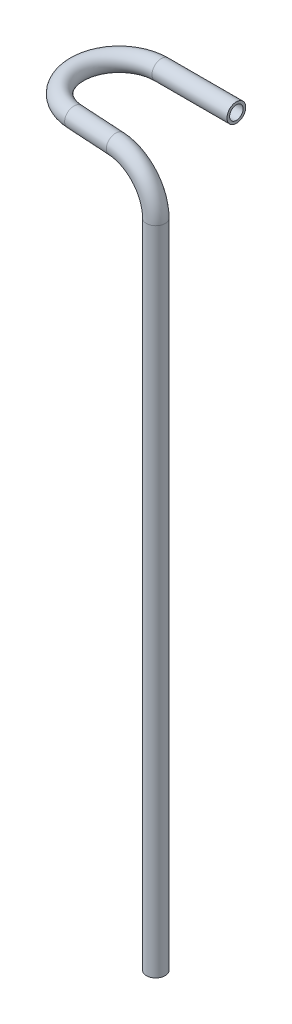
ISO-10303-21;
HEADER;
FILE_DESCRIPTION(('STEP AP214'),'2;1');
FILE_NAME('part.step','',(''),(''),'','','');
FILE_SCHEMA(('AUTOMOTIVE_DESIGN { 1 0 10303 214 1 1 1 1 }'));
ENDSEC;
DATA;
#1=APPLICATION_CONTEXT('core data for automotive mechanical design processes');
#2=APPLICATION_PROTOCOL_DEFINITION('international standard','automotive_design',2000,#1);
#3=PRODUCT_CONTEXT('',#1,'mechanical');
#4=PRODUCT('Part','Part','',(#3));
#5=PRODUCT_RELATED_PRODUCT_CATEGORY('part','',(#4));
#6=PRODUCT_DEFINITION_FORMATION('','',#4);
#7=PRODUCT_DEFINITION_CONTEXT('part definition',#1,'design');
#8=PRODUCT_DEFINITION('design','',#6,#7);
#9=PRODUCT_DEFINITION_SHAPE('','',#8);
#10=(LENGTH_UNIT() NAMED_UNIT(*) SI_UNIT(.MILLI.,.METRE.));
#11=(NAMED_UNIT(*) PLANE_ANGLE_UNIT() SI_UNIT($,.RADIAN.));
#12=(NAMED_UNIT(*) SI_UNIT($,.STERADIAN.) SOLID_ANGLE_UNIT());
#13=UNCERTAINTY_MEASURE_WITH_UNIT(LENGTH_MEASURE(1.E-05),#10,'distance_accuracy_value','');
#14=(GEOMETRIC_REPRESENTATION_CONTEXT(3) GLOBAL_UNCERTAINTY_ASSIGNED_CONTEXT((#13)) GLOBAL_UNIT_ASSIGNED_CONTEXT((#10,
#11,#12)) REPRESENTATION_CONTEXT('',''));
#15=CARTESIAN_POINT('',(0.,0.,0.));
#16=DIRECTION('',(0.,0.,1.));
#17=DIRECTION('',(1.,0.,0.));
#18=AXIS2_PLACEMENT_3D('',#15,#16,#17);
#19=CARTESIAN_POINT('',(3.02259999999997,-14.2875,30.3017233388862));
#20=DIRECTION('',(0.,-1.,0.));
#21=DIRECTION('',(1.,0.,0.));
#22=AXIS2_PLACEMENT_3D('',#19,#20,#21);
#23=CYLINDRICAL_SURFACE('',#22,3.175);
#24=CARTESIAN_POINT('',(3.02259999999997,-14.2875,30.3017233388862));
#25=DIRECTION('',(0.,1.,0.));
#26=DIRECTION('',(-0.0597452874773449,0.,0.998213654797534));
#27=AXIS2_PLACEMENT_3D('',#24,#25,#26);
#28=CIRCLE('',#27,3.175);
#29=CARTESIAN_POINT('',(6.19192835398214,-14.2875,30.4914146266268));
#30=VERTEX_POINT('',#29);
#31=EDGE_CURVE('E42',#30,#30,#28,.T.);
#32=ORIENTED_EDGE('',*,*,#31,.F.);
#33=EDGE_LOOP('',(#32));
#34=FACE_BOUND('',#33,.T.);
#35=CARTESIAN_POINT('',(3.02260000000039,-234.95,30.301723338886));
#36=DIRECTION('',(0.,1.,0.));
#37=DIRECTION('',(-0.0597452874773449,0.,0.998213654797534));
#38=AXIS2_PLACEMENT_3D('',#35,#36,#37);
#39=CIRCLE('',#38,3.175);
#40=CARTESIAN_POINT('',(2.83290871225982,-234.95,33.4710516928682));
#41=VERTEX_POINT('',#40);
#42=EDGE_CURVE('E10',#41,#41,#39,.T.);
#43=ORIENTED_EDGE('',*,*,#42,.T.);
#44=EDGE_LOOP('',(#43));
#45=FACE_BOUND('',#44,.T.);
#46=ADVANCED_FACE('F32',(#34,#45),#23,.T.);
#47=CARTESIAN_POINT('',(3.02259999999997,-14.2875,30.3017233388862));
#48=DIRECTION('',(0.,-1.,0.));
#49=DIRECTION('',(1.,0.,0.));
#50=AXIS2_PLACEMENT_3D('',#47,#48,#49);
#51=CYLINDRICAL_SURFACE('',#50,2.286);
#52=CARTESIAN_POINT('',(3.02259999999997,-14.2875,30.3017233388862));
#53=DIRECTION('',(0.,1.,0.));
#54=DIRECTION('',(-0.0597452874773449,0.,0.998213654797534));
#55=AXIS2_PLACEMENT_3D('',#52,#53,#54);
#56=CIRCLE('',#55,2.286);
#57=CARTESIAN_POINT('',(5.30451641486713,-14.2875,30.4383010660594));
#58=VERTEX_POINT('',#57);
#59=EDGE_CURVE('E46',#58,#58,#56,.T.);
#60=ORIENTED_EDGE('',*,*,#59,.T.);
#61=EDGE_LOOP('',(#60));
#62=FACE_BOUND('',#61,.T.);
#63=CARTESIAN_POINT('',(3.02260000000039,-234.95,30.301723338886));
#64=DIRECTION('',(0.,1.,0.));
#65=DIRECTION('',(-0.0597452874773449,0.,0.998213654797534));
#66=AXIS2_PLACEMENT_3D('',#63,#64,#65);
#67=CIRCLE('',#66,2.286);
#68=CARTESIAN_POINT('',(2.88602227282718,-234.95,32.5836397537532));
#69=VERTEX_POINT('',#68);
#70=EDGE_CURVE('E38',#69,#69,#67,.T.);
#71=ORIENTED_EDGE('',*,*,#70,.F.);
#72=EDGE_LOOP('',(#71));
#73=FACE_BOUND('',#72,.T.);
#74=ADVANCED_FACE('F101',(#62,#73),#51,.F.);
#75=CARTESIAN_POINT('',(-11.2393775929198,-14.2875,29.4481125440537));
#76=DIRECTION('',(0.0597452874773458,0.,-0.998213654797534));
#77=DIRECTION('',(-0.998213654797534,0.,-0.0597452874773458));
#78=AXIS2_PLACEMENT_3D('',#75,#76,#77);
#79=TOROIDAL_SURFACE('',#78,14.2875,3.175);
#80=CARTESIAN_POINT('',(-11.2393775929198,0.,29.4481125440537));
#81=DIRECTION('',(-0.998213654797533,0.,-0.0597452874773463));
#82=DIRECTION('',(-0.0597452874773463,0.,0.998213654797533));
#83=AXIS2_PLACEMENT_3D('',#80,#81,#82);
#84=CIRCLE('',#83,3.175);
#85=CARTESIAN_POINT('',(-11.2393775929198,3.175,29.4481125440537));
#86=VERTEX_POINT('',#85);
#87=EDGE_CURVE('E51',#86,#86,#84,.T.);
#88=CARTESIAN_POINT('',(-11.2393775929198,-14.2875,29.4481125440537));
#89=DIRECTION('',(0.0597452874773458,0.,-0.998213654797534));
#90=DIRECTION('',(-0.998213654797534,0.,-0.0597452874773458));
#91=AXIS2_PLACEMENT_3D('',#88,#89,#90);
#92=CIRCLE('',#91,17.4625);
#93=EDGE_CURVE('',#86,#30,#92,.T.);
#94=ORIENTED_EDGE('',*,*,#87,.F.);
#95=ORIENTED_EDGE('',*,*,#31,.T.);
#96=ORIENTED_EDGE('',*,*,#93,.T.);
#97=ORIENTED_EDGE('',*,*,#93,.F.);
#98=EDGE_LOOP('',(#94,#96,#95,#97));
#99=FACE_BOUND('',#98,.T.);
#100=ADVANCED_FACE('F106',(#99),#79,.T.);
#101=CARTESIAN_POINT('',(-11.2393775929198,-14.2875,29.4481125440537));
#102=DIRECTION('',(0.0597452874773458,0.,-0.998213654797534));
#103=DIRECTION('',(-0.998213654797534,0.,-0.0597452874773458));
#104=AXIS2_PLACEMENT_3D('',#101,#102,#103);
#105=TOROIDAL_SURFACE('',#104,14.2875,2.286);
#106=CARTESIAN_POINT('',(-11.2393775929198,0.,29.4481125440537));
#107=DIRECTION('',(-0.998213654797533,0.,-0.0597452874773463));
#108=DIRECTION('',(-0.0597452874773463,0.,0.998213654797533));
#109=AXIS2_PLACEMENT_3D('',#106,#107,#108);
#110=CIRCLE('',#109,2.286);
#111=CARTESIAN_POINT('',(-11.2393775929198,2.286,29.4481125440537));
#112=VERTEX_POINT('',#111);
#113=EDGE_CURVE('E54',#112,#112,#110,.T.);
#114=CARTESIAN_POINT('',(-11.2393775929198,-14.2875,29.4481125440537));
#115=DIRECTION('',(0.0597452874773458,0.,-0.998213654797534));
#116=DIRECTION('',(-0.998213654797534,0.,-0.0597452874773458));
#117=AXIS2_PLACEMENT_3D('',#114,#115,#116);
#118=CIRCLE('',#117,16.5735);
#119=EDGE_CURVE('',#112,#58,#118,.T.);
#120=ORIENTED_EDGE('',*,*,#113,.T.);
#121=ORIENTED_EDGE('',*,*,#59,.F.);
#122=ORIENTED_EDGE('',*,*,#119,.T.);
#123=ORIENTED_EDGE('',*,*,#119,.F.);
#124=EDGE_LOOP('',(#120,#122,#121,#123));
#125=FACE_BOUND('',#124,.T.);
#126=ADVANCED_FACE('F111',(#125),#105,.F.);
#127=CARTESIAN_POINT('',(-26.2536107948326,0.,28.5494775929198));
#128=DIRECTION('',(0.998213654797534,0.,0.0597452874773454));
#129=DIRECTION('',(0.0597452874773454,0.,-0.998213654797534));
#130=AXIS2_PLACEMENT_3D('',#127,#128,#129);
#131=CYLINDRICAL_SURFACE('',#130,3.175);
#132=CARTESIAN_POINT('',(-26.2536107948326,0.,28.5494775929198));
#133=DIRECTION('',(-0.998213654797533,0.,-0.0597452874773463));
#134=DIRECTION('',(-0.0597452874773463,0.,0.998213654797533));
#135=AXIS2_PLACEMENT_3D('',#132,#133,#134);
#136=CIRCLE('',#135,3.175);
#137=CARTESIAN_POINT('',(-26.4433020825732,0.,31.7188059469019));
#138=VERTEX_POINT('',#137);
#139=EDGE_CURVE('E57',#138,#138,#136,.T.);
#140=ORIENTED_EDGE('',*,*,#139,.F.);
#141=EDGE_LOOP('',(#140));
#142=FACE_BOUND('',#141,.T.);
#143=ORIENTED_EDGE('',*,*,#87,.T.);
#144=EDGE_LOOP('',(#143));
#145=FACE_BOUND('',#144,.T.);
#146=ADVANCED_FACE('F117',(#142,#145),#131,.T.);
#147=CARTESIAN_POINT('',(-26.2536107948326,0.,28.5494775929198));
#148=DIRECTION('',(0.998213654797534,0.,0.0597452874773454));
#149=DIRECTION('',(0.0597452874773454,0.,-0.998213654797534));
#150=AXIS2_PLACEMENT_3D('',#147,#148,#149);
#151=CYLINDRICAL_SURFACE('',#150,2.286);
#152=CARTESIAN_POINT('',(-26.2536107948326,0.,28.5494775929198));
#153=DIRECTION('',(-0.998213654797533,0.,-0.0597452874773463));
#154=DIRECTION('',(-0.0597452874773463,0.,0.998213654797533));
#155=AXIS2_PLACEMENT_3D('',#152,#153,#154);
#156=CIRCLE('',#155,2.286);
#157=CARTESIAN_POINT('',(-26.3901885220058,0.,30.8313940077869));
#158=VERTEX_POINT('',#157);
#159=EDGE_CURVE('E60',#158,#158,#156,.T.);
#160=ORIENTED_EDGE('',*,*,#159,.T.);
#161=EDGE_LOOP('',(#160));
#162=FACE_BOUND('',#161,.T.);
#163=ORIENTED_EDGE('',*,*,#113,.F.);
#164=EDGE_LOOP('',(#163));
#165=FACE_BOUND('',#164,.T.);
#166=ADVANCED_FACE('F124',(#162,#165),#151,.F.);
#167=CARTESIAN_POINT('',(-25.4,0.,14.2875));
#168=DIRECTION('',(0.,1.,0.));
#169=DIRECTION('',(0.,0.,1.));
#170=AXIS2_PLACEMENT_3D('',#167,#168,#169);
#171=TOROIDAL_SURFACE('',#170,14.2875,3.175);
#172=CARTESIAN_POINT('',(-25.4,0.,0.));
#173=DIRECTION('',(1.,0.,0.));
#174=DIRECTION('',(0.,0.,-1.));
#175=AXIS2_PLACEMENT_3D('',#172,#173,#174);
#176=CIRCLE('',#175,3.175);
#177=CARTESIAN_POINT('',(-25.4,0.,-3.175));
#178=VERTEX_POINT('',#177);
#179=EDGE_CURVE('E63',#178,#178,#176,.T.);
#180=CARTESIAN_POINT('',(-25.4,0.,14.2875));
#181=DIRECTION('',(0.,1.,0.));
#182=DIRECTION('',(0.,0.,1.));
#183=AXIS2_PLACEMENT_3D('',#180,#181,#182);
#184=CIRCLE('',#183,17.4625);
#185=EDGE_CURVE('',#178,#138,#184,.T.);
#186=ORIENTED_EDGE('',*,*,#179,.F.);
#187=ORIENTED_EDGE('',*,*,#139,.T.);
#188=ORIENTED_EDGE('',*,*,#185,.T.);
#189=ORIENTED_EDGE('',*,*,#185,.F.);
#190=EDGE_LOOP('',(#186,#188,#187,#189));
#191=FACE_BOUND('',#190,.T.);
#192=ADVANCED_FACE('F128',(#191),#171,.T.);
#193=CARTESIAN_POINT('',(-25.4,0.,14.2875));
#194=DIRECTION('',(0.,1.,0.));
#195=DIRECTION('',(0.,0.,1.));
#196=AXIS2_PLACEMENT_3D('',#193,#194,#195);
#197=TOROIDAL_SURFACE('',#196,14.2875,2.286);
#198=CARTESIAN_POINT('',(-25.4,0.,0.));
#199=DIRECTION('',(1.,0.,0.));
#200=DIRECTION('',(0.,0.,-1.));
#201=AXIS2_PLACEMENT_3D('',#198,#199,#200);
#202=CIRCLE('',#201,2.286);
#203=CARTESIAN_POINT('',(-25.4,0.,-2.286));
#204=VERTEX_POINT('',#203);
#205=EDGE_CURVE('E67',#204,#204,#202,.T.);
#206=CARTESIAN_POINT('',(-25.4,0.,14.2875));
#207=DIRECTION('',(0.,1.,0.));
#208=DIRECTION('',(0.,0.,1.));
#209=AXIS2_PLACEMENT_3D('',#206,#207,#208);
#210=CIRCLE('',#209,16.5735);
#211=EDGE_CURVE('',#204,#158,#210,.T.);
#212=ORIENTED_EDGE('',*,*,#205,.T.);
#213=ORIENTED_EDGE('',*,*,#159,.F.);
#214=ORIENTED_EDGE('',*,*,#211,.T.);
#215=ORIENTED_EDGE('',*,*,#211,.F.);
#216=EDGE_LOOP('',(#212,#214,#213,#215));
#217=FACE_BOUND('',#216,.T.);
#218=ADVANCED_FACE('F76',(#217),#197,.F.);
#219=CARTESIAN_POINT('',(-25.4,0.,0.));
#220=DIRECTION('',(1.,0.,0.));
#221=DIRECTION('',(0.,0.,-1.));
#222=AXIS2_PLACEMENT_3D('',#219,#220,#221);
#223=CYLINDRICAL_SURFACE('',#222,2.286);
#224=ORIENTED_EDGE('',*,*,#205,.F.);
#225=EDGE_LOOP('',(#224));
#226=FACE_BOUND('',#225,.T.);
#227=CARTESIAN_POINT('',(0.,0.,0.));
#228=DIRECTION('',(1.,0.,0.));
#229=DIRECTION('',(0.,0.,-1.));
#230=AXIS2_PLACEMENT_3D('',#227,#228,#229);
#231=CIRCLE('',#230,2.286);
#232=CARTESIAN_POINT('',(0.,0.,-2.286));
#233=VERTEX_POINT('',#232);
#234=EDGE_CURVE('E68',#233,#233,#231,.T.);
#235=ORIENTED_EDGE('',*,*,#234,.T.);
#236=EDGE_LOOP('',(#235));
#237=FACE_BOUND('',#236,.T.);
#238=ADVANCED_FACE('F79',(#226,#237),#223,.F.);
#239=CARTESIAN_POINT('',(-25.4,0.,0.));
#240=DIRECTION('',(1.,0.,0.));
#241=DIRECTION('',(0.,0.,-1.));
#242=AXIS2_PLACEMENT_3D('',#239,#240,#241);
#243=CYLINDRICAL_SURFACE('',#242,3.175);
#244=ORIENTED_EDGE('',*,*,#179,.T.);
#245=EDGE_LOOP('',(#244));
#246=FACE_BOUND('',#245,.T.);
#247=CARTESIAN_POINT('',(0.,0.,0.));
#248=DIRECTION('',(1.,0.,0.));
#249=DIRECTION('',(0.,0.,-1.));
#250=AXIS2_PLACEMENT_3D('',#247,#248,#249);
#251=CIRCLE('',#250,3.175);
#252=CARTESIAN_POINT('',(0.,0.,-3.175));
#253=VERTEX_POINT('',#252);
#254=EDGE_CURVE('E64',#253,#253,#251,.T.);
#255=ORIENTED_EDGE('',*,*,#254,.F.);
#256=EDGE_LOOP('',(#255));
#257=FACE_BOUND('',#256,.T.);
#258=ADVANCED_FACE('F82',(#246,#257),#243,.T.);
#259=CARTESIAN_POINT('',(3.02260000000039,-234.95,30.301723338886));
#260=DIRECTION('',(0.,1.,0.));
#261=DIRECTION('',(-0.0597452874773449,0.,0.998213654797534));
#262=AXIS2_PLACEMENT_3D('',#259,#260,#261);
#263=PLANE('',#262);
#264=ORIENTED_EDGE('',*,*,#70,.T.);
#265=EDGE_LOOP('',(#264));
#266=FACE_BOUND('',#265,.T.);
#267=ORIENTED_EDGE('',*,*,#42,.F.);
#268=EDGE_LOOP('',(#267));
#269=FACE_BOUND('',#268,.T.);
#270=ADVANCED_FACE('F89',(#266,#269),#263,.F.);
#271=CARTESIAN_POINT('',(0.,0.,0.));
#272=DIRECTION('',(1.,0.,0.));
#273=DIRECTION('',(0.,0.,-1.));
#274=AXIS2_PLACEMENT_3D('',#271,#272,#273);
#275=PLANE('',#274);
#276=ORIENTED_EDGE('',*,*,#234,.F.);
#277=EDGE_LOOP('',(#276));
#278=FACE_BOUND('',#277,.T.);
#279=ORIENTED_EDGE('',*,*,#254,.T.);
#280=EDGE_LOOP('',(#279));
#281=FACE_BOUND('',#280,.T.);
#282=ADVANCED_FACE('F86',(#278,#281),#275,.T.);
#283=CLOSED_SHELL('',(#46,#74,#100,#126,#146,#166,#192,#218,#238,#258,#270,#282));
#284=MANIFOLD_SOLID_BREP('B2',#283);
#285=ADVANCED_BREP_SHAPE_REPRESENTATION('',(#18,#284),#14);
#286=SHAPE_DEFINITION_REPRESENTATION(#9,#285);
ENDSEC;
END-ISO-10303-21;
